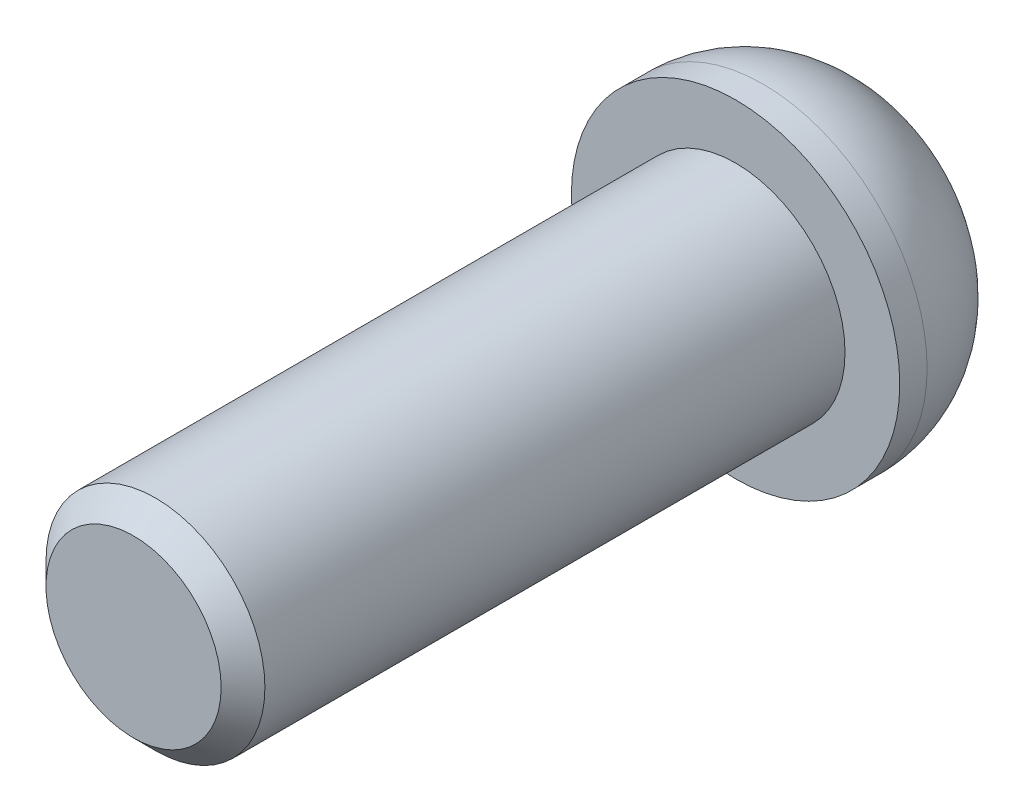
ISO-10303-21;
HEADER;
FILE_DESCRIPTION(('STEP AP214'),'2;1');
FILE_NAME('part.step','',(''),(''),'','','');
FILE_SCHEMA(('AUTOMOTIVE_DESIGN { 1 0 10303 214 1 1 1 1 }'));
ENDSEC;
DATA;
#1=APPLICATION_CONTEXT('core data for automotive mechanical design processes');
#2=APPLICATION_PROTOCOL_DEFINITION('international standard','automotive_design',2000,#1);
#3=PRODUCT_CONTEXT('',#1,'mechanical');
#4=PRODUCT('Part','Part','',(#3));
#5=PRODUCT_RELATED_PRODUCT_CATEGORY('part','',(#4));
#6=PRODUCT_DEFINITION_FORMATION('','',#4);
#7=PRODUCT_DEFINITION_CONTEXT('part definition',#1,'design');
#8=PRODUCT_DEFINITION('design','',#6,#7);
#9=PRODUCT_DEFINITION_SHAPE('','',#8);
#10=(LENGTH_UNIT() NAMED_UNIT(*) SI_UNIT(.MILLI.,.METRE.));
#11=(NAMED_UNIT(*) PLANE_ANGLE_UNIT() SI_UNIT($,.RADIAN.));
#12=(NAMED_UNIT(*) SI_UNIT($,.STERADIAN.) SOLID_ANGLE_UNIT());
#13=UNCERTAINTY_MEASURE_WITH_UNIT(LENGTH_MEASURE(1.E-05),#10,'distance_accuracy_value','');
#14=(GEOMETRIC_REPRESENTATION_CONTEXT(3) GLOBAL_UNCERTAINTY_ASSIGNED_CONTEXT((#13)) GLOBAL_UNIT_ASSIGNED_CONTEXT((#10,
#11,#12)) REPRESENTATION_CONTEXT('',''));
#15=CARTESIAN_POINT('',(0.,0.,0.));
#16=DIRECTION('',(0.,0.,1.));
#17=DIRECTION('',(1.,0.,0.));
#18=AXIS2_PLACEMENT_3D('',#15,#16,#17);
#19=CARTESIAN_POINT('',(0.,0.,-1.));
#20=DIRECTION('',(0.,0.,-1.));
#21=DIRECTION('',(-1.,0.,0.));
#22=AXIS2_PLACEMENT_3D('',#19,#20,#21);
#23=DEGENERATE_TOROIDAL_SURFACE('',#22,1.5,4.5,.T.);
#24=CARTESIAN_POINT('',(0.,0.,-1.));
#25=DIRECTION('',(0.,0.,-1.));
#26=DIRECTION('',(-1.,0.,0.));
#27=AXIS2_PLACEMENT_3D('',#24,#25,#26);
#28=CIRCLE('',#27,6.);
#29=CARTESIAN_POINT('',(-6.,0.,-1.));
#30=VERTEX_POINT('',#29);
#31=EDGE_CURVE('E104',#30,#30,#28,.T.);
#32=ORIENTED_EDGE('',*,*,#31,.T.);
#33=EDGE_LOOP('',(#32));
#34=FACE_BOUND('',#33,.T.);
#35=CARTESIAN_POINT('',(-3.,0.,-5.24264068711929));
#36=CARTESIAN_POINT('',(-3.,0.106235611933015,-5.24263949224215));
#37=CARTESIAN_POINT('',(-3.,0.212466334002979,-5.24065218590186));
#38=CARTESIAN_POINT('',(-3.,0.424775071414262,-5.23262299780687));
#39=CARTESIAN_POINT('',(-3.,0.530853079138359,-5.22658092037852));
#40=CARTESIAN_POINT('',(-3.,0.848689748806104,-5.20207775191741));
#41=CARTESIAN_POINT('',(-3.,1.06001518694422,-5.17723961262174));
#42=CARTESIAN_POINT('',(-3.,1.47852757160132,-5.10800809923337));
#43=CARTESIAN_POINT('',(-3.,1.68572886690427,-5.06370327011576));
#44=CARTESIAN_POINT('',(-3.,2.09397220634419,-4.95262336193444));
#45=CARTESIAN_POINT('',(-3.,2.29502078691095,-4.88587310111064));
#46=CARTESIAN_POINT('',(-3.,2.60616926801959,-4.76060307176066));
#47=CARTESIAN_POINT('',(-3.,2.71952529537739,-4.71007776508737));
#48=CARTESIAN_POINT('',(-3.,2.94201444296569,-4.60043007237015));
#49=CARTESIAN_POINT('',(-3.,3.05114801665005,-4.54130861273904));
#50=CARTESIAN_POINT('',(-3.,3.26430134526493,-4.41442738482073));
#51=CARTESIAN_POINT('',(-3.,3.36832042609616,-4.3466664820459));
#52=CARTESIAN_POINT('',(-3.,3.57031812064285,-4.20265018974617));
#53=CARTESIAN_POINT('',(-3.,3.66829662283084,-4.12639464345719));
#54=CARTESIAN_POINT('',(-3.,3.85774604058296,-3.9653126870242));
#55=CARTESIAN_POINT('',(-3.,3.94918406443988,-3.88044752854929));
#56=CARTESIAN_POINT('',(-3.,4.12418125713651,-3.70287619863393));
#57=CARTESIAN_POINT('',(-3.,4.2077374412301,-3.61016708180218));
#58=CARTESIAN_POINT('',(-3.,4.36606006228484,-3.41757723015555));
#59=CARTESIAN_POINT('',(-3.,4.44082980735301,-3.31769921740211));
#60=CARTESIAN_POINT('',(-3.,4.5808709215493,-3.11143338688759));
#61=CARTESIAN_POINT('',(-3.,4.64613902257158,-3.00504334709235));
#62=CARTESIAN_POINT('',(-3.,4.76237670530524,-2.79404402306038));
#63=CARTESIAN_POINT('',(-3.,4.81401568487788,-2.68980302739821));
#64=CARTESIAN_POINT('',(-3.,4.90795864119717,-2.47714833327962));
#65=CARTESIAN_POINT('',(-3.,4.95025923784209,-2.36873314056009));
#66=CARTESIAN_POINT('',(-3.,5.02507846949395,-2.14864951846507));
#67=CARTESIAN_POINT('',(-3.,5.05760363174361,-2.03698331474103));
#68=CARTESIAN_POINT('',(-3.,5.11261717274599,-1.81119389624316));
#69=CARTESIAN_POINT('',(-3.,5.13510193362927,-1.69706981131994));
#70=CARTESIAN_POINT('',(-3.,5.1855293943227,-1.36286611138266));
#71=CARTESIAN_POINT('',(-3.,5.1999223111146,-1.14057767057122));
#72=CARTESIAN_POINT('',(-3.,5.19068849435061,-0.696926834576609));
#73=CARTESIAN_POINT('',(-3.,5.16706539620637,-0.475564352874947));
#74=CARTESIAN_POINT('',(-3.,5.08315277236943,-0.0425431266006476));
#75=CARTESIAN_POINT('',(-3.,5.02328901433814,0.169198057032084));
#76=CARTESIAN_POINT('',(-3.,4.86926580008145,0.57976055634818));
#77=CARTESIAN_POINT('',(-3.,4.7751091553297,0.778582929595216));
#78=CARTESIAN_POINT('',(-3.,4.55430118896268,1.16039899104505));
#79=CARTESIAN_POINT('',(-3.,4.42727866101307,1.34317762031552));
#80=CARTESIAN_POINT('',(-3.,4.14543120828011,1.68588944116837));
#81=CARTESIAN_POINT('',(-3.,3.99059590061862,1.8458140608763));
#82=CARTESIAN_POINT('',(-3.,3.65104925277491,2.14580620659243));
#83=CARTESIAN_POINT('',(-3.,3.46535730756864,2.2847597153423));
#84=CARTESIAN_POINT('',(-3.,3.0751909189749,2.53254712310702));
#85=CARTESIAN_POINT('',(-3.,2.87073222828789,2.64140598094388));
#86=CARTESIAN_POINT('',(-3.,2.51303879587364,2.80083705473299));
#87=CARTESIAN_POINT('',(-3.,2.36312749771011,2.85906808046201));
#88=CARTESIAN_POINT('',(-3.,2.05866247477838,2.96191606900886));
#89=CARTESIAN_POINT('',(-3.,1.90410728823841,3.00652869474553));
#90=CARTESIAN_POINT('',(-3.,1.59113761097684,3.08335556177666));
#91=CARTESIAN_POINT('',(-3.,1.43270714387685,3.11550362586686));
#92=CARTESIAN_POINT('',(-3.,1.1139659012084,3.16839749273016));
#93=CARTESIAN_POINT('',(-3.,0.953654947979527,3.18914220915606));
#94=CARTESIAN_POINT('',(-3.,0.68108593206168,3.21569206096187));
#95=CARTESIAN_POINT('',(-3.,0.569070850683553,3.22412335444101));
#96=CARTESIAN_POINT('',(-3.,0.344778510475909,3.23637578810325));
#97=CARTESIAN_POINT('',(-3.,0.23250123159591,3.24019656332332));
#98=CARTESIAN_POINT('',(-3.,0.00781434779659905,3.2433824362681));
#99=CARTESIAN_POINT('',(-3.,-0.104595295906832,3.24274471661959));
#100=CARTESIAN_POINT('',(-3.,-0.329298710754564,3.23698082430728));
#101=CARTESIAN_POINT('',(-3.,-0.441592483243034,3.23185470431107));
#102=CARTESIAN_POINT('',(-3.,-0.66547675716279,3.21693634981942));
#103=CARTESIAN_POINT('',(-3.,-0.777068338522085,3.20716081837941));
#104=CARTESIAN_POINT('',(-3.,-0.999700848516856,3.18261749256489));
#105=CARTESIAN_POINT('',(-3.,-1.11074170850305,3.16784909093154));
#106=CARTESIAN_POINT('',(-3.,-1.44236615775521,3.11544322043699));
#107=CARTESIAN_POINT('',(-3.,-1.66179295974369,3.06968493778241));
#108=CARTESIAN_POINT('',(-3.,-2.00610733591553,2.97682275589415));
#109=CARTESIAN_POINT('',(-3.,-2.13321212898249,2.93780607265));
#110=CARTESIAN_POINT('',(-3.,-2.38414729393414,2.85039235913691));
#111=CARTESIAN_POINT('',(-3.,-2.50797865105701,2.80199818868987));
#112=CARTESIAN_POINT('',(-3.,-2.75125299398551,2.69551015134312));
#113=CARTESIAN_POINT('',(-3.,-2.87070059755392,2.63742687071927));
#114=CARTESIAN_POINT('',(-3.,-3.10427715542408,2.51136880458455));
#115=CARTESIAN_POINT('',(-3.,-3.21840607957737,2.44339396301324));
#116=CARTESIAN_POINT('',(-3.,-3.44110072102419,2.29704687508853));
#117=CARTESIAN_POINT('',(-3.,-3.54961548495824,2.21859688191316));
#118=CARTESIAN_POINT('',(-3.,-3.75894467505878,2.05202253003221));
#119=CARTESIAN_POINT('',(-3.,-3.8597598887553,1.96389916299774));
#120=CARTESIAN_POINT('',(-3.,-4.05263576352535,1.77842866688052));
#121=CARTESIAN_POINT('',(-3.,-4.1446915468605,1.68107645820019));
#122=CARTESIAN_POINT('',(-3.,-4.31891815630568,1.47789786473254));
#123=CARTESIAN_POINT('',(-3.,-4.40109010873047,1.3720724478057));
#124=CARTESIAN_POINT('',(-3.,-4.54643438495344,1.16446650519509));
#125=CARTESIAN_POINT('',(-3.,-4.61069753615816,1.06344804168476));
#126=CARTESIAN_POINT('',(-3.,-4.72996144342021,0.856033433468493));
#127=CARTESIAN_POINT('',(-3.,-4.78495913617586,0.749635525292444));
#128=CARTESIAN_POINT('',(-3.,-4.88507638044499,0.532403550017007));
#129=CARTESIAN_POINT('',(-3.,-4.93020545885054,0.421573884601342));
#130=CARTESIAN_POINT('',(-3.,-5.01022120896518,0.196265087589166));
#131=CARTESIAN_POINT('',(-3.,-5.04510424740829,0.0817846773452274));
#132=CARTESIAN_POINT('',(-3.,-5.13001100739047,-0.250893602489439));
#133=CARTESIAN_POINT('',(-3.,-5.16678689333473,-0.472639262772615));
#134=CARTESIAN_POINT('',(-3.,-5.20174368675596,-0.91902341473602));
#135=CARTESIAN_POINT('',(-3.,-5.1999290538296,-1.14366156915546));
#136=CARTESIAN_POINT('',(-3.,-5.15825140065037,-1.58495021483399));
#137=CARTESIAN_POINT('',(-3.,-5.11913344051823,-1.80167099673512));
#138=CARTESIAN_POINT('',(-3.,-5.00524104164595,-2.22549681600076));
#139=CARTESIAN_POINT('',(-3.,-4.93046840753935,-2.43260233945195));
#140=CARTESIAN_POINT('',(-3.,-4.74728289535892,-2.83264502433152));
#141=CARTESIAN_POINT('',(-3.,-4.63869596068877,-3.02550233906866));
#142=CARTESIAN_POINT('',(-3.,-4.39160310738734,-3.39093989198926));
#143=CARTESIAN_POINT('',(-3.,-4.25309491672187,-3.56351858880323));
#144=CARTESIAN_POINT('',(-3.,-3.94582464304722,-3.88962572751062));
#145=CARTESIAN_POINT('',(-3.,-3.77624930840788,-4.04238605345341));
#146=CARTESIAN_POINT('',(-3.,-3.41546125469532,-4.31960240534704));
#147=CARTESIAN_POINT('',(-3.,-3.22424507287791,-4.44405389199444));
#148=CARTESIAN_POINT('',(-3.,-2.81019497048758,-4.67239316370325));
#149=CARTESIAN_POINT('',(-3.,-2.58605749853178,-4.77390276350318));
#150=CARTESIAN_POINT('',(-3.,-2.12599927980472,-4.94433820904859));
#151=CARTESIAN_POINT('',(-3.,-1.89007882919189,-5.01326487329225));
#152=CARTESIAN_POINT('',(-3.,-1.3810647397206,-5.12939698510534));
#153=CARTESIAN_POINT('',(-3.,-1.10709195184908,-5.17266971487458));
#154=CARTESIAN_POINT('',(-3.,-0.693632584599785,-5.21508446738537));
#155=CARTESIAN_POINT('',(-3.,-0.555119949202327,-5.2254717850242));
#156=CARTESIAN_POINT('',(-3.,-0.27773540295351,-5.23925037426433));
#157=CARTESIAN_POINT('',(-3.,-0.138863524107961,-5.24264224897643));
#158=CARTESIAN_POINT('',(-3.,0.,-5.24264068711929));
#159=B_SPLINE_CURVE_WITH_KNOTS('',3,(#35,#36,#37,#38,#39,#40,#41,#42,#43,#44,#45,#46,#47,#48,
#49,#50,#51,#52,#53,#54,#55,#56,#57,#58,#59,#60,#61,#62,#63,#64,#65,#66,#67,#68,#69,#70,#71,#72,
#73,#74,#75,#76,#77,#78,#79,#80,#81,#82,#83,#84,#85,#86,#87,#88,#89,#90,#91,#92,#93,#94,#95,#96,
#97,#98,#99,#100,#101,#102,#103,#104,#105,#106,#107,#108,#109,#110,#111,#112,#113,#114,#115,
#116,#117,#118,#119,#120,#121,#122,#123,#124,#125,#126,#127,#128,#129,#130,#131,#132,#133,#134,
#135,#136,#137,#138,#139,#140,#141,#142,#143,#144,#145,#146,#147,#148,#149,#150,#151,#152,#153,
#154,#155,#156,#157,#158),.UNSPECIFIED.,.T.,.F.,(4,2,2,2,2,2,2,2,2,2,2,2,2,2,2,2,2,2,2,2,2,2,2,
2,2,2,2,2,2,2,2,2,2,2,2,2,2,2,2,2,2,2,2,2,2,2,2,2,2,2,2,2,2,2,2,2,2,2,2,2,2,4),(0.,
0.318674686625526,0.637364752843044,1.2748522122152,1.90946957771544,2.54338753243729,
2.91538752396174,3.28734745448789,3.65935627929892,4.03137197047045,4.4051432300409,
4.7790554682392,5.15282647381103,5.52672573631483,5.87527563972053,6.22395149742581,
6.57239401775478,6.92096199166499,7.58571138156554,8.25039720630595,8.90742164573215,
9.56439223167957,10.2291341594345,10.8941247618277,11.5870032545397,12.2793053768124,
12.7611450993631,13.2431381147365,13.727656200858,14.2122204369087,14.5491272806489,
14.8860607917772,15.2232072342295,15.5603497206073,15.8962900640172,16.2322712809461,
16.9032115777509,17.3017800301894,17.7002271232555,18.0982416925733,18.4962585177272,
18.8974132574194,19.2985269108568,19.6998626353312,20.1011525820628,20.4598672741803,
20.8187003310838,21.1771854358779,21.535797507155,22.2065378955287,22.8772007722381,
23.5347430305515,24.1922520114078,24.853203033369,25.514204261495,26.1959561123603,
26.8778172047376,27.6131539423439,28.3484722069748,29.1783423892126,29.5949268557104,
30.0114754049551),.UNSPECIFIED.);
#160=CARTESIAN_POINT('',(-3.,-1.73205080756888,-5.04874114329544));
#161=VERTEX_POINT('',#160);
#162=CARTESIAN_POINT('',(-3.,1.73205080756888,-5.04874114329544));
#163=VERTEX_POINT('',#162);
#164=EDGE_CURVE('E177',#161,#163,#159,.T.);
#165=ORIENTED_EDGE('',*,*,#164,.F.);
#166=CARTESIAN_POINT('',(0.000199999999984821,-3.4642170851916,-5.04868512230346));
#167=CARTESIAN_POINT('',(-0.0880572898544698,-3.41326171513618,-5.07340804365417));
#168=CARTESIAN_POINT('',(-0.176855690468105,-3.36199393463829,-5.09545850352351));
#169=CARTESIAN_POINT('',(-0.355238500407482,-3.25900457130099,-5.1345672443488));
#170=CARTESIAN_POINT('',(-0.444822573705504,-3.20728318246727,-5.15162756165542));
#171=CARTESIAN_POINT('',(-0.624544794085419,-3.10352051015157,-5.18112701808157));
#172=CARTESIAN_POINT('',(-0.71468288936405,-3.05147925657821,-5.19356658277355));
#173=CARTESIAN_POINT('',(-0.89532970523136,-2.94718276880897,-5.21415032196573));
#174=CARTESIAN_POINT('',(-0.985838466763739,-2.89492751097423,-5.22229400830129));
#175=CARTESIAN_POINT('',(-1.25438139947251,-2.73988417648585,-5.24047876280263));
#176=CARTESIAN_POINT('',(-1.43272157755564,-2.63691942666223,-5.24478751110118));
#177=CARTESIAN_POINT('',(-1.78918301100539,-2.4311163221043,-5.23855836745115));
#178=CARTESIAN_POINT('',(-1.96730430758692,-2.32827794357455,-5.2280239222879));
#179=CARTESIAN_POINT('',(-2.21649805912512,-2.18440586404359,-5.20181563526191));
#180=CARTESIAN_POINT('',(-2.28812943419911,-2.1430494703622,-5.19294194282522));
#181=CARTESIAN_POINT('',(-2.43106610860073,-2.06052494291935,-5.17236840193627));
#182=CARTESIAN_POINT('',(-2.50237151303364,-2.01935674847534,-5.16066954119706));
#183=CARTESIAN_POINT('',(-2.64508448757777,-1.93696137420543,-5.1341775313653));
#184=CARTESIAN_POINT('',(-2.71648902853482,-1.89573594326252,-5.11936249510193));
#185=CARTESIAN_POINT('',(-2.85877926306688,-1.81358463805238,-5.08649691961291));
#186=CARTESIAN_POINT('',(-2.92966463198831,-1.77265895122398,-5.06844451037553));
#187=CARTESIAN_POINT('',(-3.0002,-1.73193533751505,-5.04868512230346));
#188=B_SPLINE_CURVE_WITH_KNOTS('',3,(#166,#167,#168,#169,#170,#171,#172,#173,#174,#175,#176,
#177,#178,#179,#180,#181,#182,#183,#184,#185,#186,#187),.UNSPECIFIED.,.F.,.F.,(4,2,2,2,2,2,2,2,
2,2,4),(0.,0.314530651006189,0.628932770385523,0.943305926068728,1.2577147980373,
1.87506574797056,2.49227336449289,2.74179737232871,2.99123426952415,3.24248542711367,
3.49388218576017),.UNSPECIFIED.);
#189=CARTESIAN_POINT('',(0.,-3.46410161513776,-5.04874114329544));
#190=VERTEX_POINT('',#189);
#191=EDGE_CURVE('E141',#190,#161,#188,.T.);
#192=ORIENTED_EDGE('',*,*,#191,.F.);
#193=CARTESIAN_POINT('',(3.0002,-1.73193533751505,-5.04868512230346));
#194=CARTESIAN_POINT('',(2.91194271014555,-1.78289070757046,-5.07340804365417));
#195=CARTESIAN_POINT('',(2.82314430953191,-1.83415848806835,-5.09545850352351));
#196=CARTESIAN_POINT('',(2.64476149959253,-1.93714785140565,-5.1345672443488));
#197=CARTESIAN_POINT('',(2.55517742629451,-1.98886924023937,-5.15162756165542));
#198=CARTESIAN_POINT('',(2.3754552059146,-2.09263191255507,-5.18112701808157));
#199=CARTESIAN_POINT('',(2.28531711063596,-2.14467316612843,-5.19356658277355));
#200=CARTESIAN_POINT('',(2.10467029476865,-2.24896965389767,-5.21415032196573));
#201=CARTESIAN_POINT('',(2.01416153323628,-2.30122491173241,-5.22229400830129));
#202=CARTESIAN_POINT('',(1.74561860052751,-2.45626824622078,-5.24047876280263));
#203=CARTESIAN_POINT('',(1.56727842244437,-2.55923299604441,-5.24478751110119));
#204=CARTESIAN_POINT('',(1.21081698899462,-2.76503610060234,-5.23855836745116));
#205=CARTESIAN_POINT('',(1.03269569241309,-2.86787447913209,-5.2280239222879));
#206=CARTESIAN_POINT('',(0.783501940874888,-3.01174655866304,-5.20181563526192));
#207=CARTESIAN_POINT('',(0.711870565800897,-3.05310295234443,-5.19294194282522));
#208=CARTESIAN_POINT('',(0.568933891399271,-3.13562747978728,-5.17236840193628));
#209=CARTESIAN_POINT('',(0.497628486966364,-3.1767956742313,-5.16066954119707));
#210=CARTESIAN_POINT('',(0.354915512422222,-3.25919104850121,-5.13417753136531));
#211=CARTESIAN_POINT('',(0.283510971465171,-3.30041647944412,-5.11936249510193));
#212=CARTESIAN_POINT('',(0.141220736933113,-3.38256778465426,-5.08649691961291));
#213=CARTESIAN_POINT('',(0.0703353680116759,-3.42349347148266,-5.06844451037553));
#214=CARTESIAN_POINT('',(-0.000200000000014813,-3.4642170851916,-5.04868512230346));
#215=B_SPLINE_CURVE_WITH_KNOTS('',3,(#193,#194,#195,#196,#197,#198,#199,#200,#201,#202,#203,
#204,#205,#206,#207,#208,#209,#210,#211,#212,#213,#214),.UNSPECIFIED.,.F.,.F.,(4,2,2,2,2,2,2,2,
2,2,4),(0.,0.314530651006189,0.628932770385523,0.943305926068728,1.2577147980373,
1.87506574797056,2.49227336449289,2.74179737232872,2.99123426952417,3.24248542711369,
3.4938821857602),.UNSPECIFIED.);
#216=CARTESIAN_POINT('',(3.,-1.73205080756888,-5.04874114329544));
#217=VERTEX_POINT('',#216);
#218=EDGE_CURVE('E117',#217,#190,#215,.T.);
#219=ORIENTED_EDGE('',*,*,#218,.F.);
#220=CARTESIAN_POINT('',(3.,0.,-5.24264068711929));
#221=CARTESIAN_POINT('',(3.,-0.106235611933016,-5.24263949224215));
#222=CARTESIAN_POINT('',(3.,-0.21246633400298,-5.24065218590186));
#223=CARTESIAN_POINT('',(3.,-0.424775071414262,-5.23262299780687));
#224=CARTESIAN_POINT('',(3.,-0.53085307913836,-5.22658092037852));
#225=CARTESIAN_POINT('',(3.,-0.848689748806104,-5.20207775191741));
#226=CARTESIAN_POINT('',(3.,-1.06001518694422,-5.17723961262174));
#227=CARTESIAN_POINT('',(3.,-1.47852757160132,-5.10800809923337));
#228=CARTESIAN_POINT('',(3.,-1.68572886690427,-5.06370327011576));
#229=CARTESIAN_POINT('',(3.,-2.09397220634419,-4.95262336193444));
#230=CARTESIAN_POINT('',(3.,-2.29502078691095,-4.88587310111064));
#231=CARTESIAN_POINT('',(3.,-2.60616926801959,-4.76060307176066));
#232=CARTESIAN_POINT('',(3.,-2.71952529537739,-4.71007776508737));
#233=CARTESIAN_POINT('',(3.,-2.94201444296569,-4.60043007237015));
#234=CARTESIAN_POINT('',(3.,-3.05114801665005,-4.54130861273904));
#235=CARTESIAN_POINT('',(3.,-3.26430134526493,-4.41442738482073));
#236=CARTESIAN_POINT('',(3.,-3.36832042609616,-4.3466664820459));
#237=CARTESIAN_POINT('',(3.,-3.57031812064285,-4.20265018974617));
#238=CARTESIAN_POINT('',(3.,-3.66829662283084,-4.12639464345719));
#239=CARTESIAN_POINT('',(3.,-3.85774604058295,-3.9653126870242));
#240=CARTESIAN_POINT('',(3.,-3.94918406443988,-3.88044752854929));
#241=CARTESIAN_POINT('',(3.,-4.12418125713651,-3.70287619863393));
#242=CARTESIAN_POINT('',(3.,-4.2077374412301,-3.61016708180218));
#243=CARTESIAN_POINT('',(3.,-4.36606006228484,-3.41757723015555));
#244=CARTESIAN_POINT('',(3.,-4.44082980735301,-3.31769921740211));
#245=CARTESIAN_POINT('',(3.,-4.5808709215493,-3.11143338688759));
#246=CARTESIAN_POINT('',(3.,-4.64613902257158,-3.00504334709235));
#247=CARTESIAN_POINT('',(3.,-4.76237670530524,-2.79404402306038));
#248=CARTESIAN_POINT('',(3.,-4.81401568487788,-2.68980302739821));
#249=CARTESIAN_POINT('',(3.,-4.90795864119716,-2.47714833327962));
#250=CARTESIAN_POINT('',(3.,-4.95025923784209,-2.36873314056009));
#251=CARTESIAN_POINT('',(3.,-5.02507846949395,-2.14864951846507));
#252=CARTESIAN_POINT('',(3.,-5.05760363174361,-2.03698331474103));
#253=CARTESIAN_POINT('',(3.,-5.11261717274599,-1.81119389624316));
#254=CARTESIAN_POINT('',(3.,-5.13510193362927,-1.69706981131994));
#255=CARTESIAN_POINT('',(3.,-5.1855293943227,-1.36286611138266));
#256=CARTESIAN_POINT('',(3.,-5.1999223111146,-1.14057767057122));
#257=CARTESIAN_POINT('',(3.,-5.19068849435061,-0.696926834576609));
#258=CARTESIAN_POINT('',(3.,-5.16706539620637,-0.475564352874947));
#259=CARTESIAN_POINT('',(3.,-5.08315277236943,-0.0425431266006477));
#260=CARTESIAN_POINT('',(3.,-5.02328901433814,0.169198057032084));
#261=CARTESIAN_POINT('',(3.,-4.86926580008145,0.57976055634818));
#262=CARTESIAN_POINT('',(3.,-4.7751091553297,0.778582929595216));
#263=CARTESIAN_POINT('',(3.,-4.55430118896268,1.16039899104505));
#264=CARTESIAN_POINT('',(3.,-4.42727866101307,1.34317762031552));
#265=CARTESIAN_POINT('',(3.,-4.14543120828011,1.68588944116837));
#266=CARTESIAN_POINT('',(3.,-3.99059590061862,1.8458140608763));
#267=CARTESIAN_POINT('',(3.,-3.65104925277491,2.14580620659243));
#268=CARTESIAN_POINT('',(3.,-3.46535730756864,2.2847597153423));
#269=CARTESIAN_POINT('',(3.,-3.0751909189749,2.53254712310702));
#270=CARTESIAN_POINT('',(3.,-2.87073222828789,2.64140598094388));
#271=CARTESIAN_POINT('',(3.,-2.51303879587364,2.80083705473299));
#272=CARTESIAN_POINT('',(3.,-2.36312749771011,2.85906808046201));
#273=CARTESIAN_POINT('',(3.,-2.05866247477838,2.96191606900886));
#274=CARTESIAN_POINT('',(3.,-1.90410728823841,3.00652869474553));
#275=CARTESIAN_POINT('',(3.,-1.59113761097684,3.08335556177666));
#276=CARTESIAN_POINT('',(3.,-1.43270714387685,3.11550362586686));
#277=CARTESIAN_POINT('',(3.,-1.1139659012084,3.16839749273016));
#278=CARTESIAN_POINT('',(3.,-0.953654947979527,3.18914220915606));
#279=CARTESIAN_POINT('',(3.,-0.681085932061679,3.21569206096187));
#280=CARTESIAN_POINT('',(3.,-0.569070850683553,3.22412335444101));
#281=CARTESIAN_POINT('',(3.,-0.344778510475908,3.23637578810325));
#282=CARTESIAN_POINT('',(3.,-0.232501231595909,3.24019656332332));
#283=CARTESIAN_POINT('',(3.,-0.00781434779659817,3.2433824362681));
#284=CARTESIAN_POINT('',(3.,0.104595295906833,3.24274471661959));
#285=CARTESIAN_POINT('',(3.,0.329298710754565,3.23698082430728));
#286=CARTESIAN_POINT('',(3.,0.441592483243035,3.23185470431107));
#287=CARTESIAN_POINT('',(3.,0.665476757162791,3.21693634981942));
#288=CARTESIAN_POINT('',(3.,0.777068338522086,3.20716081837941));
#289=CARTESIAN_POINT('',(3.,0.999700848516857,3.18261749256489));
#290=CARTESIAN_POINT('',(3.,1.11074170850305,3.16784909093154));
#291=CARTESIAN_POINT('',(3.,1.44236615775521,3.11544322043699));
#292=CARTESIAN_POINT('',(3.,1.66179295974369,3.06968493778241));
#293=CARTESIAN_POINT('',(3.,2.00610733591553,2.97682275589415));
#294=CARTESIAN_POINT('',(3.,2.13321212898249,2.93780607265));
#295=CARTESIAN_POINT('',(3.,2.38414729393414,2.85039235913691));
#296=CARTESIAN_POINT('',(3.,2.50797865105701,2.80199818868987));
#297=CARTESIAN_POINT('',(3.,2.75125299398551,2.69551015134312));
#298=CARTESIAN_POINT('',(3.,2.87070059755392,2.63742687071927));
#299=CARTESIAN_POINT('',(3.,3.10427715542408,2.51136880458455));
#300=CARTESIAN_POINT('',(3.,3.21840607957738,2.44339396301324));
#301=CARTESIAN_POINT('',(3.,3.44110072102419,2.29704687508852));
#302=CARTESIAN_POINT('',(3.,3.54961548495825,2.21859688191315));
#303=CARTESIAN_POINT('',(3.,3.75894467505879,2.0520225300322));
#304=CARTESIAN_POINT('',(3.,3.8597598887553,1.96389916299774));
#305=CARTESIAN_POINT('',(3.,4.05263576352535,1.77842866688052));
#306=CARTESIAN_POINT('',(3.,4.14469154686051,1.68107645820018));
#307=CARTESIAN_POINT('',(3.,4.31891815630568,1.47789786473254));
#308=CARTESIAN_POINT('',(3.,4.40109010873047,1.3720724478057));
#309=CARTESIAN_POINT('',(3.,4.54643438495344,1.16446650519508));
#310=CARTESIAN_POINT('',(3.,4.61069753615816,1.06344804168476));
#311=CARTESIAN_POINT('',(3.,4.72996144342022,0.856033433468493));
#312=CARTESIAN_POINT('',(3.,4.78495913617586,0.749635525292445));
#313=CARTESIAN_POINT('',(3.,4.88507638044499,0.532403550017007));
#314=CARTESIAN_POINT('',(3.,4.93020545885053,0.421573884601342));
#315=CARTESIAN_POINT('',(3.,5.01022120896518,0.196265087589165));
#316=CARTESIAN_POINT('',(3.,5.04510424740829,0.0817846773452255));
#317=CARTESIAN_POINT('',(3.,5.13001100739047,-0.25089360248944));
#318=CARTESIAN_POINT('',(3.,5.16678689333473,-0.472639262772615));
#319=CARTESIAN_POINT('',(3.,5.20174368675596,-0.91902341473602));
#320=CARTESIAN_POINT('',(3.,5.1999290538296,-1.14366156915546));
#321=CARTESIAN_POINT('',(3.,5.15825140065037,-1.58495021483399));
#322=CARTESIAN_POINT('',(3.,5.11913344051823,-1.80167099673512));
#323=CARTESIAN_POINT('',(3.,5.00524104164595,-2.22549681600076));
#324=CARTESIAN_POINT('',(3.,4.93046840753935,-2.43260233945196));
#325=CARTESIAN_POINT('',(3.,4.74728289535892,-2.83264502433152));
#326=CARTESIAN_POINT('',(3.,4.63869596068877,-3.02550233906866));
#327=CARTESIAN_POINT('',(3.,4.39160310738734,-3.39093989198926));
#328=CARTESIAN_POINT('',(3.,4.25309491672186,-3.56351858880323));
#329=CARTESIAN_POINT('',(3.,3.94582464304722,-3.88962572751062));
#330=CARTESIAN_POINT('',(3.,3.77624930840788,-4.04238605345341));
#331=CARTESIAN_POINT('',(3.,3.41546125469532,-4.31960240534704));
#332=CARTESIAN_POINT('',(3.,3.22424507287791,-4.44405389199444));
#333=CARTESIAN_POINT('',(3.,2.81019497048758,-4.67239316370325));
#334=CARTESIAN_POINT('',(3.,2.58605749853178,-4.77390276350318));
#335=CARTESIAN_POINT('',(3.,2.12599927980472,-4.94433820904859));
#336=CARTESIAN_POINT('',(3.,1.89007882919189,-5.01326487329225));
#337=CARTESIAN_POINT('',(3.,1.3810647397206,-5.12939698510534));
#338=CARTESIAN_POINT('',(3.,1.10709195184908,-5.17266971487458));
#339=CARTESIAN_POINT('',(3.,0.693632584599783,-5.21508446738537));
#340=CARTESIAN_POINT('',(3.,0.555119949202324,-5.22547178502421));
#341=CARTESIAN_POINT('',(3.,0.277735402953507,-5.23925037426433));
#342=CARTESIAN_POINT('',(3.,0.138863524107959,-5.24264224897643));
#343=CARTESIAN_POINT('',(3.,0.,-5.24264068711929));
#344=B_SPLINE_CURVE_WITH_KNOTS('',3,(#220,#221,#222,#223,#224,#225,#226,#227,#228,#229,#230,
#231,#232,#233,#234,#235,#236,#237,#238,#239,#240,#241,#242,#243,#244,#245,#246,#247,#248,#249,
#250,#251,#252,#253,#254,#255,#256,#257,#258,#259,#260,#261,#262,#263,#264,#265,#266,#267,#268,
#269,#270,#271,#272,#273,#274,#275,#276,#277,#278,#279,#280,#281,#282,#283,#284,#285,#286,#287,
#288,#289,#290,#291,#292,#293,#294,#295,#296,#297,#298,#299,#300,#301,#302,#303,#304,#305,#306,
#307,#308,#309,#310,#311,#312,#313,#314,#315,#316,#317,#318,#319,#320,#321,#322,#323,#324,#325,
#326,#327,#328,#329,#330,#331,#332,#333,#334,#335,#336,#337,#338,#339,#340,#341,#342,#343),
.UNSPECIFIED.,.T.,.F.,(4,2,2,2,2,2,2,2,2,2,2,2,2,2,2,2,2,2,2,2,2,2,2,2,2,2,2,2,2,2,2,2,2,2,2,2,
2,2,2,2,2,2,2,2,2,2,2,2,2,2,2,2,2,2,2,2,2,2,2,2,2,4),(0.,0.318674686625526,0.637364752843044,
1.2748522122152,1.90946957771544,2.54338753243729,2.91538752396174,3.28734745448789,
3.65935627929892,4.03137197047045,4.4051432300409,4.7790554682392,5.15282647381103,
5.52672573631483,5.87527563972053,6.22395149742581,6.57239401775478,6.92096199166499,
7.58571138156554,8.25039720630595,8.90742164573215,9.56439223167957,10.2291341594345,
10.8941247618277,11.5870032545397,12.2793053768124,12.7611450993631,13.2431381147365,
13.727656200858,14.2122204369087,14.5491272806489,14.8860607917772,15.2232072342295,
15.5603497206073,15.8962900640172,16.2322712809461,16.9032115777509,17.3017800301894,
17.7002271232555,18.0982416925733,18.4962585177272,18.8974132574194,19.2985269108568,
19.6998626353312,20.1011525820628,20.4598672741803,20.8187003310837,21.1771854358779,
21.535797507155,22.2065378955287,22.8772007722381,23.5347430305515,24.1922520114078,
24.853203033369,25.514204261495,26.1959561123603,26.8778172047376,27.6131539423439,
28.3484722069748,29.1783423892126,29.5949268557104,30.0114754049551),.UNSPECIFIED.);
#345=CARTESIAN_POINT('',(3.,1.73205080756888,-5.04874114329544));
#346=VERTEX_POINT('',#345);
#347=EDGE_CURVE('E112',#346,#217,#344,.T.);
#348=ORIENTED_EDGE('',*,*,#347,.F.);
#349=CARTESIAN_POINT('',(-0.000200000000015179,3.4642170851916,-5.04868512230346));
#350=CARTESIAN_POINT('',(0.0880572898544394,3.41326171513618,-5.07340804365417));
#351=CARTESIAN_POINT('',(0.176855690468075,3.36199393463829,-5.09545850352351));
#352=CARTESIAN_POINT('',(0.355238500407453,3.25900457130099,-5.1345672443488));
#353=CARTESIAN_POINT('',(0.444822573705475,3.20728318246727,-5.15162756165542));
#354=CARTESIAN_POINT('',(0.62454479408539,3.10352051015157,-5.18112701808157));
#355=CARTESIAN_POINT('',(0.714682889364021,3.05147925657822,-5.19356658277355));
#356=CARTESIAN_POINT('',(0.895329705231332,2.94718276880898,-5.21415032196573));
#357=CARTESIAN_POINT('',(0.985838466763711,2.89492751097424,-5.22229400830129));
#358=CARTESIAN_POINT('',(1.25438139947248,2.73988417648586,-5.24047876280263));
#359=CARTESIAN_POINT('',(1.43272157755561,2.63691942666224,-5.24478751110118));
#360=CARTESIAN_POINT('',(1.78918301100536,2.4311163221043,-5.23855836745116));
#361=CARTESIAN_POINT('',(1.96730430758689,2.32827794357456,-5.2280239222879));
#362=CARTESIAN_POINT('',(2.2164980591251,2.1844058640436,-5.20181563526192));
#363=CARTESIAN_POINT('',(2.28812943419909,2.14304947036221,-5.19294194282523));
#364=CARTESIAN_POINT('',(2.43106610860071,2.06052494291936,-5.17236840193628));
#365=CARTESIAN_POINT('',(2.50237151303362,2.01935674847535,-5.16066954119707));
#366=CARTESIAN_POINT('',(2.64508448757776,1.93696137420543,-5.13417753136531));
#367=CARTESIAN_POINT('',(2.71648902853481,1.89573594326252,-5.11936249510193));
#368=CARTESIAN_POINT('',(2.85877926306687,1.81358463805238,-5.08649691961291));
#369=CARTESIAN_POINT('',(2.92966463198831,1.77265895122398,-5.06844451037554));
#370=CARTESIAN_POINT('',(3.0002,1.73193533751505,-5.04868512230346));
#371=B_SPLINE_CURVE_WITH_KNOTS('',3,(#349,#350,#351,#352,#353,#354,#355,#356,#357,#358,#359,
#360,#361,#362,#363,#364,#365,#366,#367,#368,#369,#370),.UNSPECIFIED.,.F.,.F.,(4,2,2,2,2,2,2,2,
2,2,4),(0.,0.314530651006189,0.628932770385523,0.943305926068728,1.2577147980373,
1.87506574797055,2.49227336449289,2.74179737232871,2.99123426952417,3.24248542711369,
3.4938821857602),.UNSPECIFIED.);
#372=CARTESIAN_POINT('',(0.,3.46410161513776,-5.04874114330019));
#373=VERTEX_POINT('',#372);
#374=EDGE_CURVE('E146',#373,#346,#371,.T.);
#375=ORIENTED_EDGE('',*,*,#374,.F.);
#376=CARTESIAN_POINT('',(-3.0002,1.73193533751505,-5.04868512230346));
#377=CARTESIAN_POINT('',(-2.91194271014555,1.78289070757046,-5.07340804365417));
#378=CARTESIAN_POINT('',(-2.82314430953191,1.83415848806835,-5.09545850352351));
#379=CARTESIAN_POINT('',(-2.64476149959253,1.93714785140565,-5.1345672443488));
#380=CARTESIAN_POINT('',(-2.55517742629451,1.98886924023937,-5.15162756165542));
#381=CARTESIAN_POINT('',(-2.3754552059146,2.09263191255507,-5.18112701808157));
#382=CARTESIAN_POINT('',(-2.28531711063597,2.14467316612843,-5.19356658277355));
#383=CARTESIAN_POINT('',(-2.10467029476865,2.24896965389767,-5.21415032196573));
#384=CARTESIAN_POINT('',(-2.01416153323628,2.30122491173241,-5.22229400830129));
#385=CARTESIAN_POINT('',(-1.74561860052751,2.45626824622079,-5.24047876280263));
#386=CARTESIAN_POINT('',(-1.56727842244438,2.55923299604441,-5.24478751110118));
#387=CARTESIAN_POINT('',(-1.21081698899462,2.76503610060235,-5.23855836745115));
#388=CARTESIAN_POINT('',(-1.0326956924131,2.8678744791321,-5.2280239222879));
#389=CARTESIAN_POINT('',(-0.783501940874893,3.01174655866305,-5.20181563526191));
#390=CARTESIAN_POINT('',(-0.711870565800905,3.05310295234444,-5.19294194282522));
#391=CARTESIAN_POINT('',(-0.568933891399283,3.13562747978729,-5.17236840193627));
#392=CARTESIAN_POINT('',(-0.497628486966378,3.1767956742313,-5.16066954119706));
#393=CARTESIAN_POINT('',(-0.35491551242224,3.25919104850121,-5.1341775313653));
#394=CARTESIAN_POINT('',(-0.283510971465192,3.30041647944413,-5.11936249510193));
#395=CARTESIAN_POINT('',(-0.141220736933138,3.38256778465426,-5.08649691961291));
#396=CARTESIAN_POINT('',(-0.0703353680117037,3.42349347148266,-5.06844451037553));
#397=CARTESIAN_POINT('',(0.000199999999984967,3.4642170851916,-5.04868512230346));
#398=B_SPLINE_CURVE_WITH_KNOTS('',3,(#376,#377,#378,#379,#380,#381,#382,#383,#384,#385,#386,
#387,#388,#389,#390,#391,#392,#393,#394,#395,#396,#397),.UNSPECIFIED.,.F.,.F.,(4,2,2,2,2,2,2,2,
2,2,4),(0.,0.314530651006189,0.628932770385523,0.943305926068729,1.2577147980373,
1.87506574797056,2.49227336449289,2.74179737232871,2.99123426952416,3.24248542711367,
3.49388218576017),.UNSPECIFIED.);
#399=EDGE_CURVE('E52',#163,#373,#398,.T.);
#400=ORIENTED_EDGE('',*,*,#399,.F.);
#401=EDGE_LOOP('',(#165,#192,#219,#348,#375,#400));
#402=FACE_BOUND('',#401,.T.);
#403=ADVANCED_FACE('F29',(#34,#402),#23,.T.);
#404=CARTESIAN_POINT('',(0.,0.,0.));
#405=DIRECTION('',(0.,0.,-1.));
#406=DIRECTION('',(-1.,0.,0.));
#407=AXIS2_PLACEMENT_3D('',#404,#405,#406);
#408=CYLINDRICAL_SURFACE('',#407,6.);
#409=ORIENTED_EDGE('',*,*,#31,.F.);
#410=EDGE_LOOP('',(#409));
#411=FACE_BOUND('',#410,.T.);
#412=CARTESIAN_POINT('',(0.,0.,0.));
#413=DIRECTION('',(0.,0.,-1.));
#414=DIRECTION('',(-1.,0.,0.));
#415=AXIS2_PLACEMENT_3D('',#412,#413,#414);
#416=CIRCLE('',#415,6.);
#417=CARTESIAN_POINT('',(-6.,0.,0.));
#418=VERTEX_POINT('',#417);
#419=EDGE_CURVE('E100',#418,#418,#416,.T.);
#420=ORIENTED_EDGE('',*,*,#419,.T.);
#421=EDGE_LOOP('',(#420));
#422=FACE_BOUND('',#421,.T.);
#423=ADVANCED_FACE('F162',(#411,#422),#408,.T.);
#424=CARTESIAN_POINT('',(0.,0.,0.));
#425=DIRECTION('',(0.,0.,-1.));
#426=DIRECTION('',(-1.,0.,0.));
#427=AXIS2_PLACEMENT_3D('',#424,#425,#426);
#428=PLANE('',#427);
#429=CARTESIAN_POINT('',(0.,0.,0.));
#430=DIRECTION('',(0.,0.,1.));
#431=DIRECTION('',(1.,0.,0.));
#432=AXIS2_PLACEMENT_3D('',#429,#430,#431);
#433=CIRCLE('',#432,4.);
#434=CARTESIAN_POINT('',(4.,0.,0.));
#435=VERTEX_POINT('',#434);
#436=EDGE_CURVE('E97',#435,#435,#433,.T.);
#437=ORIENTED_EDGE('',*,*,#436,.F.);
#438=EDGE_LOOP('',(#437));
#439=FACE_BOUND('',#438,.T.);
#440=ORIENTED_EDGE('',*,*,#419,.F.);
#441=EDGE_LOOP('',(#440));
#442=FACE_BOUND('',#441,.T.);
#443=ADVANCED_FACE('F160',(#439,#442),#428,.F.);
#444=CARTESIAN_POINT('',(0.,3.46410161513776,-1.5));
#445=DIRECTION('',(0.500000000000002,-0.866025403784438,0.));
#446=DIRECTION('',(0.866025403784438,0.500000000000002,0.));
#447=AXIS2_PLACEMENT_3D('',#444,#445,#446);
#448=PLANE('',#447);
#449=ORIENTED_EDGE('',*,*,#399,.T.);
#450=DIRECTION('',(0.,0.,-1.));
#451=VECTOR('',#450,1.);
#452=CARTESIAN_POINT('',(0.,3.46410161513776,-1.5));
#453=LINE('',#452,#451);
#454=CARTESIAN_POINT('',(0.,3.46410161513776,-1.5));
#455=VERTEX_POINT('',#454);
#456=EDGE_CURVE('E95',#455,#373,#453,.T.);
#457=ORIENTED_EDGE('',*,*,#456,.F.);
#458=DIRECTION('',(-0.866025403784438,-0.500000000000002,0.));
#459=VECTOR('',#458,1.);
#460=CARTESIAN_POINT('',(0.,3.46410161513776,-1.5));
#461=LINE('',#460,#459);
#462=CARTESIAN_POINT('',(-3.,1.73205080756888,-1.5));
#463=VERTEX_POINT('',#462);
#464=EDGE_CURVE('E84',#455,#463,#461,.T.);
#465=ORIENTED_EDGE('',*,*,#464,.T.);
#466=DIRECTION('',(0.,0.,-1.));
#467=VECTOR('',#466,1.);
#468=CARTESIAN_POINT('',(-3.,1.73205080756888,-1.5));
#469=LINE('',#468,#467);
#470=EDGE_CURVE('E101',#463,#163,#469,.T.);
#471=ORIENTED_EDGE('',*,*,#470,.T.);
#472=EDGE_LOOP('',(#449,#457,#465,#471));
#473=FACE_BOUND('',#472,.T.);
#474=ADVANCED_FACE('F99',(#473),#448,.T.);
#475=CARTESIAN_POINT('',(0.,3.46410161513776,-1.5));
#476=DIRECTION('',(-0.499999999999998,-0.86602540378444,0.));
#477=DIRECTION('',(0.86602540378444,-0.499999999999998,0.));
#478=AXIS2_PLACEMENT_3D('',#475,#476,#477);
#479=PLANE('',#478);
#480=ORIENTED_EDGE('',*,*,#374,.T.);
#481=DIRECTION('',(0.,0.,-1.));
#482=VECTOR('',#481,1.);
#483=CARTESIAN_POINT('',(3.,1.73205080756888,-1.5));
#484=LINE('',#483,#482);
#485=CARTESIAN_POINT('',(3.,1.73205080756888,-1.5));
#486=VERTEX_POINT('',#485);
#487=EDGE_CURVE('E44',#486,#346,#484,.T.);
#488=ORIENTED_EDGE('',*,*,#487,.F.);
#489=DIRECTION('',(-0.86602540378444,0.499999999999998,0.));
#490=VECTOR('',#489,1.);
#491=CARTESIAN_POINT('',(0.,3.46410161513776,-1.5));
#492=LINE('',#491,#490);
#493=EDGE_CURVE('E88',#486,#455,#492,.T.);
#494=ORIENTED_EDGE('',*,*,#493,.T.);
#495=ORIENTED_EDGE('',*,*,#456,.T.);
#496=EDGE_LOOP('',(#480,#488,#494,#495));
#497=FACE_BOUND('',#496,.T.);
#498=ADVANCED_FACE('F94',(#497),#479,.T.);
#499=CARTESIAN_POINT('',(0.,-3.46410161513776,-1.5));
#500=DIRECTION('',(0.500000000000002,0.866025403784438,0.));
#501=DIRECTION('',(-0.866025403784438,0.500000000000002,0.));
#502=AXIS2_PLACEMENT_3D('',#499,#500,#501);
#503=PLANE('',#502);
#504=ORIENTED_EDGE('',*,*,#191,.T.);
#505=DIRECTION('',(0.,0.,-1.));
#506=VECTOR('',#505,1.);
#507=CARTESIAN_POINT('',(-3.,-1.73205080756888,-1.5));
#508=LINE('',#507,#506);
#509=CARTESIAN_POINT('',(-3.,-1.73205080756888,-1.5));
#510=VERTEX_POINT('',#509);
#511=EDGE_CURVE('E106',#510,#161,#508,.T.);
#512=ORIENTED_EDGE('',*,*,#511,.F.);
#513=DIRECTION('',(0.866025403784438,-0.500000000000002,0.));
#514=VECTOR('',#513,1.);
#515=CARTESIAN_POINT('',(0.,-3.46410161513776,-1.5));
#516=LINE('',#515,#514);
#517=CARTESIAN_POINT('',(0.,-3.46410161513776,-1.5));
#518=VERTEX_POINT('',#517);
#519=EDGE_CURVE('E283',#510,#518,#516,.T.);
#520=ORIENTED_EDGE('',*,*,#519,.T.);
#521=DIRECTION('',(0.,0.,-1.));
#522=VECTOR('',#521,1.);
#523=CARTESIAN_POINT('',(0.,-3.46410161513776,-1.5));
#524=LINE('',#523,#522);
#525=EDGE_CURVE('E293',#518,#190,#524,.T.);
#526=ORIENTED_EDGE('',*,*,#525,.T.);
#527=EDGE_LOOP('',(#504,#512,#520,#526));
#528=FACE_BOUND('',#527,.T.);
#529=ADVANCED_FACE('F133',(#528),#503,.T.);
#530=CARTESIAN_POINT('',(0.,-3.46410161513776,-1.5));
#531=DIRECTION('',(-0.499999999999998,0.86602540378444,0.));
#532=DIRECTION('',(-0.86602540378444,-0.499999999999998,0.));
#533=AXIS2_PLACEMENT_3D('',#530,#531,#532);
#534=PLANE('',#533);
#535=ORIENTED_EDGE('',*,*,#218,.T.);
#536=ORIENTED_EDGE('',*,*,#525,.F.);
#537=DIRECTION('',(0.86602540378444,0.499999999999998,0.));
#538=VECTOR('',#537,1.);
#539=CARTESIAN_POINT('',(0.,-3.46410161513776,-1.5));
#540=LINE('',#539,#538);
#541=CARTESIAN_POINT('',(3.,-1.73205080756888,-1.5));
#542=VERTEX_POINT('',#541);
#543=EDGE_CURVE('E285',#518,#542,#540,.T.);
#544=ORIENTED_EDGE('',*,*,#543,.T.);
#545=DIRECTION('',(0.,0.,-1.));
#546=VECTOR('',#545,1.);
#547=CARTESIAN_POINT('',(3.,-1.73205080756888,-1.5));
#548=LINE('',#547,#546);
#549=EDGE_CURVE('E290',#542,#217,#548,.T.);
#550=ORIENTED_EDGE('',*,*,#549,.T.);
#551=EDGE_LOOP('',(#535,#536,#544,#550));
#552=FACE_BOUND('',#551,.T.);
#553=ADVANCED_FACE('F129',(#552),#534,.T.);
#554=CARTESIAN_POINT('',(-3.,-1.73205080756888,-1.5));
#555=DIRECTION('',(1.,0.,0.));
#556=DIRECTION('',(0.,0.,-1.));
#557=AXIS2_PLACEMENT_3D('',#554,#555,#556);
#558=PLANE('',#557);
#559=ORIENTED_EDGE('',*,*,#164,.T.);
#560=ORIENTED_EDGE('',*,*,#470,.F.);
#561=DIRECTION('',(0.,-1.,0.));
#562=VECTOR('',#561,1.);
#563=CARTESIAN_POINT('',(-3.,-1.73205080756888,-1.5));
#564=LINE('',#563,#562);
#565=EDGE_CURVE('E90',#463,#510,#564,.T.);
#566=ORIENTED_EDGE('',*,*,#565,.T.);
#567=ORIENTED_EDGE('',*,*,#511,.T.);
#568=EDGE_LOOP('',(#559,#560,#566,#567));
#569=FACE_BOUND('',#568,.T.);
#570=ADVANCED_FACE('F127',(#569),#558,.T.);
#571=CARTESIAN_POINT('',(3.,-1.73205080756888,-1.5));
#572=DIRECTION('',(-1.,0.,0.));
#573=DIRECTION('',(0.,-1.,0.));
#574=AXIS2_PLACEMENT_3D('',#571,#572,#573);
#575=PLANE('',#574);
#576=ORIENTED_EDGE('',*,*,#347,.T.);
#577=ORIENTED_EDGE('',*,*,#549,.F.);
#578=DIRECTION('',(0.,1.,0.));
#579=VECTOR('',#578,1.);
#580=CARTESIAN_POINT('',(3.,-1.73205080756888,-1.5));
#581=LINE('',#580,#579);
#582=EDGE_CURVE('E287',#542,#486,#581,.T.);
#583=ORIENTED_EDGE('',*,*,#582,.T.);
#584=ORIENTED_EDGE('',*,*,#487,.T.);
#585=EDGE_LOOP('',(#576,#577,#583,#584));
#586=FACE_BOUND('',#585,.T.);
#587=ADVANCED_FACE('F123',(#586),#575,.T.);
#588=CARTESIAN_POINT('',(-3.,5.19615242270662,-1.5));
#589=DIRECTION('',(0.,0.,1.));
#590=DIRECTION('',(1.,0.,0.));
#591=AXIS2_PLACEMENT_3D('',#588,#589,#590);
#592=PLANE('',#591);
#593=ORIENTED_EDGE('',*,*,#493,.F.);
#594=ORIENTED_EDGE('',*,*,#582,.F.);
#595=ORIENTED_EDGE('',*,*,#543,.F.);
#596=ORIENTED_EDGE('',*,*,#519,.F.);
#597=ORIENTED_EDGE('',*,*,#565,.F.);
#598=ORIENTED_EDGE('',*,*,#464,.F.);
#599=EDGE_LOOP('',(#593,#594,#595,#596,#597,#598));
#600=FACE_BOUND('',#599,.T.);
#601=ADVANCED_FACE('F86',(#600),#592,.F.);
#602=CARTESIAN_POINT('',(0.,0.,22.));
#603=DIRECTION('',(0.,0.,1.));
#604=DIRECTION('',(1.,0.,0.));
#605=AXIS2_PLACEMENT_3D('',#602,#603,#604);
#606=PLANE('',#605);
#607=CARTESIAN_POINT('',(0.,0.,22.));
#608=DIRECTION('',(0.,0.,1.));
#609=DIRECTION('',(1.,0.,0.));
#610=AXIS2_PLACEMENT_3D('',#607,#608,#609);
#611=CIRCLE('',#610,3.2);
#612=CARTESIAN_POINT('',(3.2,0.,22.));
#613=VERTEX_POINT('',#612);
#614=EDGE_CURVE('E37',#613,#613,#611,.T.);
#615=ORIENTED_EDGE('',*,*,#614,.T.);
#616=EDGE_LOOP('',(#615));
#617=FACE_BOUND('',#616,.T.);
#618=ADVANCED_FACE('F186',(#617),#606,.T.);
#619=CARTESIAN_POINT('',(0.,0.,0.));
#620=DIRECTION('',(0.,0.,1.));
#621=DIRECTION('',(1.,0.,0.));
#622=AXIS2_PLACEMENT_3D('',#619,#620,#621);
#623=CYLINDRICAL_SURFACE('',#622,4.);
#624=CARTESIAN_POINT('',(0.,0.,21.2));
#625=DIRECTION('',(0.,0.,1.));
#626=DIRECTION('',(1.,0.,0.));
#627=AXIS2_PLACEMENT_3D('',#624,#625,#626);
#628=CIRCLE('',#627,4.);
#629=CARTESIAN_POINT('',(4.,0.,21.2));
#630=VERTEX_POINT('',#629);
#631=EDGE_CURVE('E11',#630,#630,#628,.F.);
#632=ORIENTED_EDGE('',*,*,#631,.T.);
#633=EDGE_LOOP('',(#632));
#634=FACE_BOUND('',#633,.T.);
#635=ORIENTED_EDGE('',*,*,#436,.T.);
#636=EDGE_LOOP('',(#635));
#637=FACE_BOUND('',#636,.T.);
#638=ADVANCED_FACE('F190',(#634,#637),#623,.T.);
#639=CARTESIAN_POINT('',(0.,0.,22.));
#640=DIRECTION('',(0.,0.,-1.));
#641=DIRECTION('',(-1.,0.,0.));
#642=AXIS2_PLACEMENT_3D('',#639,#640,#641);
#643=CONICAL_SURFACE('',#642,3.2,0.785398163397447);
#644=ORIENTED_EDGE('',*,*,#631,.F.);
#645=EDGE_LOOP('',(#644));
#646=FACE_BOUND('',#645,.T.);
#647=ORIENTED_EDGE('',*,*,#614,.F.);
#648=EDGE_LOOP('',(#647));
#649=FACE_BOUND('',#648,.T.);
#650=ADVANCED_FACE('F188',(#646,#649),#643,.T.);
#651=CLOSED_SHELL('',(#403,#423,#443,#474,#498,#529,#553,#570,#587,#601,#618,#638,#650));
#652=MANIFOLD_SOLID_BREP('B2',#651);
#653=ADVANCED_BREP_SHAPE_REPRESENTATION('',(#18,#652),#14);
#654=SHAPE_DEFINITION_REPRESENTATION(#9,#653);
ENDSEC;
END-ISO-10303-21;
